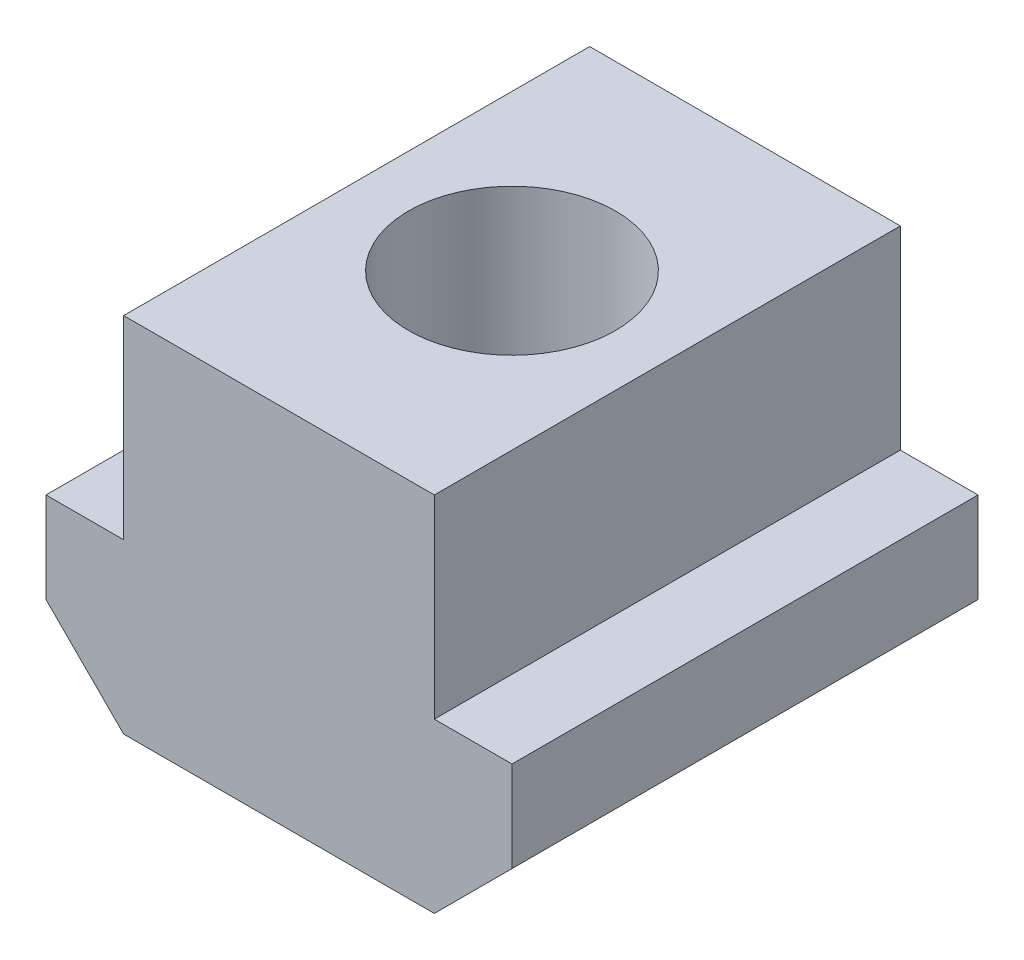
ISO-10303-21;
HEADER;
FILE_DESCRIPTION(('STEP AP214'),'2;1');
FILE_NAME('part.step','',(''),(''),'','','');
FILE_SCHEMA(('AUTOMOTIVE_DESIGN { 1 0 10303 214 1 1 1 1 }'));
ENDSEC;
DATA;
#1=APPLICATION_CONTEXT('core data for automotive mechanical design processes');
#2=APPLICATION_PROTOCOL_DEFINITION('international standard','automotive_design',2000,#1);
#3=PRODUCT_CONTEXT('',#1,'mechanical');
#4=PRODUCT('Part','Part','',(#3));
#5=PRODUCT_RELATED_PRODUCT_CATEGORY('part','',(#4));
#6=PRODUCT_DEFINITION_FORMATION('','',#4);
#7=PRODUCT_DEFINITION_CONTEXT('part definition',#1,'design');
#8=PRODUCT_DEFINITION('design','',#6,#7);
#9=PRODUCT_DEFINITION_SHAPE('','',#8);
#10=(LENGTH_UNIT() NAMED_UNIT(*) SI_UNIT(.MILLI.,.METRE.));
#11=(NAMED_UNIT(*) PLANE_ANGLE_UNIT() SI_UNIT($,.RADIAN.));
#12=(NAMED_UNIT(*) SI_UNIT($,.STERADIAN.) SOLID_ANGLE_UNIT());
#13=UNCERTAINTY_MEASURE_WITH_UNIT(LENGTH_MEASURE(1.E-05),#10,'distance_accuracy_value','');
#14=(GEOMETRIC_REPRESENTATION_CONTEXT(3) GLOBAL_UNCERTAINTY_ASSIGNED_CONTEXT((#13)) GLOBAL_UNIT_ASSIGNED_CONTEXT((#10,
#11,#12)) REPRESENTATION_CONTEXT('',''));
#15=CARTESIAN_POINT('',(0.,0.,0.));
#16=DIRECTION('',(0.,0.,1.));
#17=DIRECTION('',(1.,0.,0.));
#18=AXIS2_PLACEMENT_3D('',#15,#16,#17);
#19=CARTESIAN_POINT('',(-9.,7.,18.));
#20=DIRECTION('',(0.,-1.,0.));
#21=DIRECTION('',(0.,0.,-1.));
#22=AXIS2_PLACEMENT_3D('',#19,#20,#21);
#23=PLANE('',#22);
#24=CARTESIAN_POINT('',(0.,7.,9.));
#25=DIRECTION('',(0.,-1.,0.));
#26=DIRECTION('',(0.,0.,-1.));
#27=AXIS2_PLACEMENT_3D('',#24,#25,#26);
#28=CIRCLE('',#27,4.);
#29=CARTESIAN_POINT('',(0.,7.,5.));
#30=VERTEX_POINT('',#29);
#31=EDGE_CURVE('E126',#30,#30,#28,.T.);
#32=ORIENTED_EDGE('',*,*,#31,.T.);
#33=EDGE_LOOP('',(#32));
#34=FACE_BOUND('',#33,.T.);
#35=DIRECTION('',(-1.,0.,0.));
#36=VECTOR('',#35,1.);
#37=CARTESIAN_POINT('',(-9.,7.,0.));
#38=LINE('',#37,#36);
#39=CARTESIAN_POINT('',(-6.,7.,0.));
#40=VERTEX_POINT('',#39);
#41=CARTESIAN_POINT('',(6.,7.,0.));
#42=VERTEX_POINT('',#41);
#43=EDGE_CURVE('E25',#40,#42,#38,.F.);
#44=ORIENTED_EDGE('',*,*,#43,.F.);
#45=DIRECTION('',(0.,0.,-1.));
#46=VECTOR('',#45,1.);
#47=CARTESIAN_POINT('',(-6.,7.,18.));
#48=LINE('',#47,#46);
#49=CARTESIAN_POINT('',(-6.,7.,18.));
#50=VERTEX_POINT('',#49);
#51=EDGE_CURVE('E111',#50,#40,#48,.T.);
#52=ORIENTED_EDGE('',*,*,#51,.F.);
#53=DIRECTION('',(-1.,0.,0.));
#54=VECTOR('',#53,1.);
#55=CARTESIAN_POINT('',(-9.,7.,18.));
#56=LINE('',#55,#54);
#57=CARTESIAN_POINT('',(6.,7.,18.));
#58=VERTEX_POINT('',#57);
#59=EDGE_CURVE('E93',#58,#50,#56,.T.);
#60=ORIENTED_EDGE('',*,*,#59,.F.);
#61=DIRECTION('',(0.,0.,1.));
#62=VECTOR('',#61,1.);
#63=CARTESIAN_POINT('',(6.,7.,0.));
#64=LINE('',#63,#62);
#65=EDGE_CURVE('E117',#42,#58,#64,.T.);
#66=ORIENTED_EDGE('',*,*,#65,.F.);
#67=EDGE_LOOP('',(#44,#52,#60,#66));
#68=FACE_BOUND('',#67,.T.);
#69=ADVANCED_FACE('F17',(#34,#68),#23,.F.);
#70=CARTESIAN_POINT('',(-9.,-7.,18.));
#71=DIRECTION('',(0.,1.,0.));
#72=DIRECTION('',(0.,0.,1.));
#73=AXIS2_PLACEMENT_3D('',#70,#71,#72);
#74=PLANE('',#73);
#75=CARTESIAN_POINT('',(0.,-7.,9.));
#76=DIRECTION('',(0.,-1.,0.));
#77=DIRECTION('',(0.,0.,-1.));
#78=AXIS2_PLACEMENT_3D('',#75,#76,#77);
#79=CIRCLE('',#78,4.);
#80=CARTESIAN_POINT('',(0.,-7.,5.));
#81=VERTEX_POINT('',#80);
#82=EDGE_CURVE('E125',#81,#81,#79,.T.);
#83=ORIENTED_EDGE('',*,*,#82,.F.);
#84=EDGE_LOOP('',(#83));
#85=FACE_BOUND('',#84,.T.);
#86=DIRECTION('',(0.,0.,1.));
#87=VECTOR('',#86,1.);
#88=CARTESIAN_POINT('',(6.,-7.,18.));
#89=LINE('',#88,#87);
#90=CARTESIAN_POINT('',(6.,-7.,0.));
#91=VERTEX_POINT('',#90);
#92=CARTESIAN_POINT('',(6.,-7.,18.));
#93=VERTEX_POINT('',#92);
#94=EDGE_CURVE('E138',#91,#93,#89,.T.);
#95=ORIENTED_EDGE('',*,*,#94,.T.);
#96=DIRECTION('',(1.,0.,0.));
#97=VECTOR('',#96,1.);
#98=CARTESIAN_POINT('',(-9.,-7.,18.));
#99=LINE('',#98,#97);
#100=CARTESIAN_POINT('',(-6.,-7.,18.));
#101=VERTEX_POINT('',#100);
#102=EDGE_CURVE('E11',#101,#93,#99,.T.);
#103=ORIENTED_EDGE('',*,*,#102,.F.);
#104=DIRECTION('',(0.,0.,1.));
#105=VECTOR('',#104,1.);
#106=CARTESIAN_POINT('',(-6.,-7.,18.));
#107=LINE('',#106,#105);
#108=CARTESIAN_POINT('',(-6.,-7.,0.));
#109=VERTEX_POINT('',#108);
#110=EDGE_CURVE('E146',#101,#109,#107,.F.);
#111=ORIENTED_EDGE('',*,*,#110,.T.);
#112=DIRECTION('',(-1.,0.,0.));
#113=VECTOR('',#112,1.);
#114=CARTESIAN_POINT('',(-9.,-7.,0.));
#115=LINE('',#114,#113);
#116=EDGE_CURVE('E104',#109,#91,#115,.F.);
#117=ORIENTED_EDGE('',*,*,#116,.T.);
#118=EDGE_LOOP('',(#95,#103,#111,#117));
#119=FACE_BOUND('',#118,.T.);
#120=ADVANCED_FACE('F195',(#85,#119),#74,.F.);
#121=CARTESIAN_POINT('',(-9.,-7.,0.));
#122=DIRECTION('',(0.,0.,1.));
#123=DIRECTION('',(1.,0.,0.));
#124=AXIS2_PLACEMENT_3D('',#121,#122,#123);
#125=PLANE('',#124);
#126=DIRECTION('',(0.,-1.,0.));
#127=VECTOR('',#126,1.);
#128=CARTESIAN_POINT('',(-6.,7.,0.));
#129=LINE('',#128,#127);
#130=CARTESIAN_POINT('',(-6.,-0.5,0.));
#131=VERTEX_POINT('',#130);
#132=EDGE_CURVE('E178',#40,#131,#129,.T.);
#133=ORIENTED_EDGE('',*,*,#132,.F.);
#134=ORIENTED_EDGE('',*,*,#43,.T.);
#135=DIRECTION('',(0.,1.,0.));
#136=VECTOR('',#135,1.);
#137=CARTESIAN_POINT('',(6.,-0.5,0.));
#138=LINE('',#137,#136);
#139=CARTESIAN_POINT('',(6.,-0.5,0.));
#140=VERTEX_POINT('',#139);
#141=EDGE_CURVE('E114',#140,#42,#138,.T.);
#142=ORIENTED_EDGE('',*,*,#141,.F.);
#143=DIRECTION('',(1.,0.,0.));
#144=VECTOR('',#143,1.);
#145=CARTESIAN_POINT('',(-9.,-0.5,0.));
#146=LINE('',#145,#144);
#147=CARTESIAN_POINT('',(9.,-0.5,0.));
#148=VERTEX_POINT('',#147);
#149=EDGE_CURVE('E171',#148,#140,#146,.F.);
#150=ORIENTED_EDGE('',*,*,#149,.F.);
#151=DIRECTION('',(0.,-1.,0.));
#152=VECTOR('',#151,1.);
#153=CARTESIAN_POINT('',(9.,-7.,0.));
#154=LINE('',#153,#152);
#155=CARTESIAN_POINT('',(9.,-4.,0.));
#156=VERTEX_POINT('',#155);
#157=EDGE_CURVE('E168',#156,#148,#154,.F.);
#158=ORIENTED_EDGE('',*,*,#157,.F.);
#159=DIRECTION('',(-0.707106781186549,-0.707106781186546,0.));
#160=VECTOR('',#159,1.);
#161=CARTESIAN_POINT('',(9.,-4.,0.));
#162=LINE('',#161,#160);
#163=EDGE_CURVE('E141',#156,#91,#162,.T.);
#164=ORIENTED_EDGE('',*,*,#163,.T.);
#165=ORIENTED_EDGE('',*,*,#116,.F.);
#166=DIRECTION('',(-0.707106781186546,0.707106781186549,0.));
#167=VECTOR('',#166,1.);
#168=CARTESIAN_POINT('',(-6.,-7.,0.));
#169=LINE('',#168,#167);
#170=CARTESIAN_POINT('',(-9.,-4.,0.));
#171=VERTEX_POINT('',#170);
#172=EDGE_CURVE('E129',#109,#171,#169,.T.);
#173=ORIENTED_EDGE('',*,*,#172,.T.);
#174=DIRECTION('',(0.,-1.,0.));
#175=VECTOR('',#174,1.);
#176=CARTESIAN_POINT('',(-9.,7.,0.));
#177=LINE('',#176,#175);
#178=CARTESIAN_POINT('',(-9.,-0.5,0.));
#179=VERTEX_POINT('',#178);
#180=EDGE_CURVE('E165',#171,#179,#177,.F.);
#181=ORIENTED_EDGE('',*,*,#180,.T.);
#182=DIRECTION('',(-1.,0.,0.));
#183=VECTOR('',#182,1.);
#184=CARTESIAN_POINT('',(9.,-0.5,0.));
#185=LINE('',#184,#183);
#186=EDGE_CURVE('E174',#179,#131,#185,.F.);
#187=ORIENTED_EDGE('',*,*,#186,.T.);
#188=EDGE_LOOP('',(#133,#134,#142,#150,#158,#164,#165,#173,#181,#187));
#189=FACE_BOUND('',#188,.T.);
#190=ADVANCED_FACE('F19',(#189),#125,.F.);
#191=CARTESIAN_POINT('',(9.,7.,18.));
#192=DIRECTION('',(-1.,0.,0.));
#193=DIRECTION('',(0.,-1.,0.));
#194=AXIS2_PLACEMENT_3D('',#191,#192,#193);
#195=PLANE('',#194);
#196=DIRECTION('',(0.,0.,-1.));
#197=VECTOR('',#196,1.);
#198=CARTESIAN_POINT('',(9.,-0.5,0.));
#199=LINE('',#198,#197);
#200=CARTESIAN_POINT('',(9.,-0.5,18.));
#201=VERTEX_POINT('',#200);
#202=EDGE_CURVE('E153',#148,#201,#199,.F.);
#203=ORIENTED_EDGE('',*,*,#202,.T.);
#204=DIRECTION('',(0.,1.,0.));
#205=VECTOR('',#204,1.);
#206=CARTESIAN_POINT('',(9.,7.,18.));
#207=LINE('',#206,#205);
#208=CARTESIAN_POINT('',(9.,-4.,18.));
#209=VERTEX_POINT('',#208);
#210=EDGE_CURVE('E158',#209,#201,#207,.T.);
#211=ORIENTED_EDGE('',*,*,#210,.F.);
#212=DIRECTION('',(0.,0.,1.));
#213=VECTOR('',#212,1.);
#214=CARTESIAN_POINT('',(9.,-4.,18.));
#215=LINE('',#214,#213);
#216=EDGE_CURVE('E143',#209,#156,#215,.F.);
#217=ORIENTED_EDGE('',*,*,#216,.T.);
#218=ORIENTED_EDGE('',*,*,#157,.T.);
#219=EDGE_LOOP('',(#203,#211,#217,#218));
#220=FACE_BOUND('',#219,.T.);
#221=ADVANCED_FACE('F187',(#220),#195,.F.);
#222=CARTESIAN_POINT('',(9.,-0.5,0.));
#223=DIRECTION('',(0.,-1.,0.));
#224=DIRECTION('',(1.,0.,0.));
#225=AXIS2_PLACEMENT_3D('',#222,#223,#224);
#226=PLANE('',#225);
#227=ORIENTED_EDGE('',*,*,#149,.T.);
#228=DIRECTION('',(0.,0.,-1.));
#229=VECTOR('',#228,1.);
#230=CARTESIAN_POINT('',(6.,-0.5,18.));
#231=LINE('',#230,#229);
#232=CARTESIAN_POINT('',(6.,-0.5,18.));
#233=VERTEX_POINT('',#232);
#234=EDGE_CURVE('E123',#233,#140,#231,.T.);
#235=ORIENTED_EDGE('',*,*,#234,.F.);
#236=DIRECTION('',(-1.,0.,0.));
#237=VECTOR('',#236,1.);
#238=CARTESIAN_POINT('',(-9.,-0.5,18.));
#239=LINE('',#238,#237);
#240=EDGE_CURVE('E105',#201,#233,#239,.T.);
#241=ORIENTED_EDGE('',*,*,#240,.F.);
#242=ORIENTED_EDGE('',*,*,#202,.F.);
#243=EDGE_LOOP('',(#227,#235,#241,#242));
#244=FACE_BOUND('',#243,.T.);
#245=ADVANCED_FACE('F184',(#244),#226,.F.);
#246=CARTESIAN_POINT('',(-9.,-0.5,0.));
#247=DIRECTION('',(0.,-1.,0.));
#248=DIRECTION('',(0.,0.,-1.));
#249=AXIS2_PLACEMENT_3D('',#246,#247,#248);
#250=PLANE('',#249);
#251=DIRECTION('',(1.,0.,0.));
#252=VECTOR('',#251,1.);
#253=CARTESIAN_POINT('',(-9.,-0.5,18.));
#254=LINE('',#253,#252);
#255=CARTESIAN_POINT('',(-9.,-0.5,18.));
#256=VERTEX_POINT('',#255);
#257=CARTESIAN_POINT('',(-6.,-0.5,18.));
#258=VERTEX_POINT('',#257);
#259=EDGE_CURVE('E37',#256,#258,#254,.T.);
#260=ORIENTED_EDGE('',*,*,#259,.T.);
#261=DIRECTION('',(0.,0.,1.));
#262=VECTOR('',#261,1.);
#263=CARTESIAN_POINT('',(-6.,-0.5,0.));
#264=LINE('',#263,#262);
#265=EDGE_CURVE('E32',#131,#258,#264,.T.);
#266=ORIENTED_EDGE('',*,*,#265,.F.);
#267=ORIENTED_EDGE('',*,*,#186,.F.);
#268=DIRECTION('',(0.,0.,-1.));
#269=VECTOR('',#268,1.);
#270=CARTESIAN_POINT('',(-9.,-0.5,18.));
#271=LINE('',#270,#269);
#272=EDGE_CURVE('E135',#179,#256,#271,.F.);
#273=ORIENTED_EDGE('',*,*,#272,.T.);
#274=EDGE_LOOP('',(#260,#266,#267,#273));
#275=FACE_BOUND('',#274,.T.);
#276=ADVANCED_FACE('F204',(#275),#250,.F.);
#277=CARTESIAN_POINT('',(-9.,7.,18.));
#278=DIRECTION('',(1.,0.,0.));
#279=DIRECTION('',(0.,0.,-1.));
#280=AXIS2_PLACEMENT_3D('',#277,#278,#279);
#281=PLANE('',#280);
#282=DIRECTION('',(0.,0.,1.));
#283=VECTOR('',#282,1.);
#284=CARTESIAN_POINT('',(-9.,-4.,18.));
#285=LINE('',#284,#283);
#286=CARTESIAN_POINT('',(-9.,-4.,18.));
#287=VERTEX_POINT('',#286);
#288=EDGE_CURVE('E149',#171,#287,#285,.T.);
#289=ORIENTED_EDGE('',*,*,#288,.T.);
#290=DIRECTION('',(0.,1.,0.));
#291=VECTOR('',#290,1.);
#292=CARTESIAN_POINT('',(-9.,-7.,18.));
#293=LINE('',#292,#291);
#294=EDGE_CURVE('E155',#287,#256,#293,.T.);
#295=ORIENTED_EDGE('',*,*,#294,.T.);
#296=ORIENTED_EDGE('',*,*,#272,.F.);
#297=ORIENTED_EDGE('',*,*,#180,.F.);
#298=EDGE_LOOP('',(#289,#295,#296,#297));
#299=FACE_BOUND('',#298,.T.);
#300=ADVANCED_FACE('F203',(#299),#281,.F.);
#301=CARTESIAN_POINT('',(-6.,-7.,18.));
#302=DIRECTION('',(0.707106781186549,0.707106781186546,0.));
#303=DIRECTION('',(-0.707106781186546,0.707106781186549,0.));
#304=AXIS2_PLACEMENT_3D('',#301,#302,#303);
#305=PLANE('',#304);
#306=ORIENTED_EDGE('',*,*,#110,.F.);
#307=DIRECTION('',(0.707106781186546,-0.707106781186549,0.));
#308=VECTOR('',#307,1.);
#309=CARTESIAN_POINT('',(-8.5,-4.5,18.));
#310=LINE('',#309,#308);
#311=EDGE_CURVE('E136',#287,#101,#310,.T.);
#312=ORIENTED_EDGE('',*,*,#311,.F.);
#313=ORIENTED_EDGE('',*,*,#288,.F.);
#314=ORIENTED_EDGE('',*,*,#172,.F.);
#315=EDGE_LOOP('',(#306,#312,#313,#314));
#316=FACE_BOUND('',#315,.T.);
#317=ADVANCED_FACE('F199',(#316),#305,.F.);
#318=CARTESIAN_POINT('',(9.,-4.,18.));
#319=DIRECTION('',(-0.707106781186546,0.707106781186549,0.));
#320=DIRECTION('',(-0.707106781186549,-0.707106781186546,0.));
#321=AXIS2_PLACEMENT_3D('',#318,#319,#320);
#322=PLANE('',#321);
#323=DIRECTION('',(0.70710678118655,0.707106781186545,0.));
#324=VECTOR('',#323,1.);
#325=CARTESIAN_POINT('',(6.5,-6.5,18.));
#326=LINE('',#325,#324);
#327=EDGE_CURVE('E132',#93,#209,#326,.T.);
#328=ORIENTED_EDGE('',*,*,#327,.F.);
#329=ORIENTED_EDGE('',*,*,#94,.F.);
#330=ORIENTED_EDGE('',*,*,#163,.F.);
#331=ORIENTED_EDGE('',*,*,#216,.F.);
#332=EDGE_LOOP('',(#328,#329,#330,#331));
#333=FACE_BOUND('',#332,.T.);
#334=ADVANCED_FACE('F192',(#333),#322,.F.);
#335=CARTESIAN_POINT('',(-9.,-7.,18.));
#336=DIRECTION('',(0.,0.,1.));
#337=DIRECTION('',(1.,0.,0.));
#338=AXIS2_PLACEMENT_3D('',#335,#336,#337);
#339=PLANE('',#338);
#340=ORIENTED_EDGE('',*,*,#294,.F.);
#341=ORIENTED_EDGE('',*,*,#311,.T.);
#342=ORIENTED_EDGE('',*,*,#102,.T.);
#343=ORIENTED_EDGE('',*,*,#327,.T.);
#344=ORIENTED_EDGE('',*,*,#210,.T.);
#345=ORIENTED_EDGE('',*,*,#240,.T.);
#346=DIRECTION('',(0.,-1.,0.));
#347=VECTOR('',#346,1.);
#348=CARTESIAN_POINT('',(6.,7.,18.));
#349=LINE('',#348,#347);
#350=EDGE_CURVE('E99',#58,#233,#349,.T.);
#351=ORIENTED_EDGE('',*,*,#350,.F.);
#352=ORIENTED_EDGE('',*,*,#59,.T.);
#353=DIRECTION('',(0.,1.,0.));
#354=VECTOR('',#353,1.);
#355=CARTESIAN_POINT('',(-6.,-0.5,18.));
#356=LINE('',#355,#354);
#357=EDGE_CURVE('E97',#258,#50,#356,.T.);
#358=ORIENTED_EDGE('',*,*,#357,.F.);
#359=ORIENTED_EDGE('',*,*,#259,.F.);
#360=EDGE_LOOP('',(#340,#341,#342,#343,#344,#345,#351,#352,#358,#359));
#361=FACE_BOUND('',#360,.T.);
#362=ADVANCED_FACE('F96',(#361),#339,.T.);
#363=CARTESIAN_POINT('',(0.,7.,9.));
#364=DIRECTION('',(0.,-1.,0.));
#365=DIRECTION('',(0.,0.,-1.));
#366=AXIS2_PLACEMENT_3D('',#363,#364,#365);
#367=CYLINDRICAL_SURFACE('',#366,4.);
#368=ORIENTED_EDGE('',*,*,#31,.F.);
#369=EDGE_LOOP('',(#368));
#370=FACE_BOUND('',#369,.T.);
#371=ORIENTED_EDGE('',*,*,#82,.T.);
#372=EDGE_LOOP('',(#371));
#373=FACE_BOUND('',#372,.T.);
#374=ADVANCED_FACE('F229',(#370,#373),#367,.F.);
#375=CARTESIAN_POINT('',(6.,0.,0.));
#376=DIRECTION('',(1.,0.,0.));
#377=DIRECTION('',(0.,1.,0.));
#378=AXIS2_PLACEMENT_3D('',#375,#376,#377);
#379=PLANE('',#378);
#380=ORIENTED_EDGE('',*,*,#141,.T.);
#381=ORIENTED_EDGE('',*,*,#65,.T.);
#382=ORIENTED_EDGE('',*,*,#350,.T.);
#383=ORIENTED_EDGE('',*,*,#234,.T.);
#384=EDGE_LOOP('',(#380,#381,#382,#383));
#385=FACE_BOUND('',#384,.T.);
#386=ADVANCED_FACE('F180',(#385),#379,.T.);
#387=CARTESIAN_POINT('',(-6.,0.,0.));
#388=DIRECTION('',(-1.,0.,0.));
#389=DIRECTION('',(0.,-1.,0.));
#390=AXIS2_PLACEMENT_3D('',#387,#388,#389);
#391=PLANE('',#390);
#392=ORIENTED_EDGE('',*,*,#132,.T.);
#393=ORIENTED_EDGE('',*,*,#265,.T.);
#394=ORIENTED_EDGE('',*,*,#357,.T.);
#395=ORIENTED_EDGE('',*,*,#51,.T.);
#396=EDGE_LOOP('',(#392,#393,#394,#395));
#397=FACE_BOUND('',#396,.T.);
#398=ADVANCED_FACE('F110',(#397),#391,.T.);
#399=CLOSED_SHELL('',(#69,#120,#190,#221,#245,#276,#300,#317,#334,#362,#374,#386,#398));
#400=MANIFOLD_SOLID_BREP('B1',#399);
#401=ADVANCED_BREP_SHAPE_REPRESENTATION('',(#18,#400),#14);
#402=SHAPE_DEFINITION_REPRESENTATION(#9,#401);
ENDSEC;
END-ISO-10303-21;
